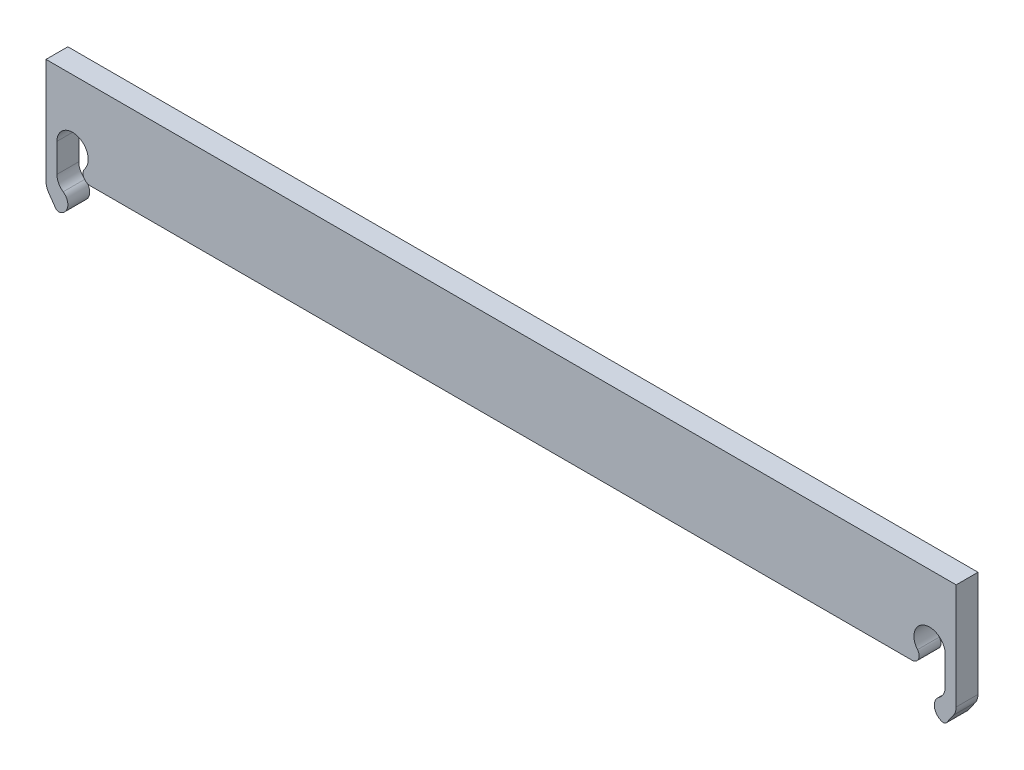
ISO-10303-21;
HEADER;
FILE_DESCRIPTION(('STEP AP214'),'2;1');
FILE_NAME('part.step','',(''),(''),'','','');
FILE_SCHEMA(('AUTOMOTIVE_DESIGN { 1 0 10303 214 1 1 1 1 }'));
ENDSEC;
DATA;
#1=APPLICATION_CONTEXT('core data for automotive mechanical design processes');
#2=APPLICATION_PROTOCOL_DEFINITION('international standard','automotive_design',2000,#1);
#3=PRODUCT_CONTEXT('',#1,'mechanical');
#4=PRODUCT('Part','Part','',(#3));
#5=PRODUCT_RELATED_PRODUCT_CATEGORY('part','',(#4));
#6=PRODUCT_DEFINITION_FORMATION('','',#4);
#7=PRODUCT_DEFINITION_CONTEXT('part definition',#1,'design');
#8=PRODUCT_DEFINITION('design','',#6,#7);
#9=PRODUCT_DEFINITION_SHAPE('','',#8);
#10=(LENGTH_UNIT() NAMED_UNIT(*) SI_UNIT(.MILLI.,.METRE.));
#11=(NAMED_UNIT(*) PLANE_ANGLE_UNIT() SI_UNIT($,.RADIAN.));
#12=(NAMED_UNIT(*) SI_UNIT($,.STERADIAN.) SOLID_ANGLE_UNIT());
#13=UNCERTAINTY_MEASURE_WITH_UNIT(LENGTH_MEASURE(1.E-05),#10,'distance_accuracy_value','');
#14=(GEOMETRIC_REPRESENTATION_CONTEXT(3) GLOBAL_UNCERTAINTY_ASSIGNED_CONTEXT((#13)) GLOBAL_UNIT_ASSIGNED_CONTEXT((#10,
#11,#12)) REPRESENTATION_CONTEXT('',''));
#15=CARTESIAN_POINT('',(0.,0.,0.));
#16=DIRECTION('',(0.,0.,1.));
#17=DIRECTION('',(1.,0.,0.));
#18=AXIS2_PLACEMENT_3D('',#15,#16,#17);
#19=CARTESIAN_POINT('',(-62.5,12.,3.));
#20=DIRECTION('',(1.,0.,0.));
#21=DIRECTION('',(0.,0.,-1.));
#22=AXIS2_PLACEMENT_3D('',#19,#20,#21);
#23=PLANE('',#22);
#24=DIRECTION('',(0.,-1.,0.));
#25=VECTOR('',#24,1.);
#26=CARTESIAN_POINT('',(-62.5,12.,0.));
#27=LINE('',#26,#25);
#28=CARTESIAN_POINT('',(-62.5,12.,0.));
#29=VERTEX_POINT('',#28);
#30=CARTESIAN_POINT('',(-62.5,-2.52740242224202,0.));
#31=VERTEX_POINT('',#30);
#32=EDGE_CURVE('E182',#29,#31,#27,.T.);
#33=ORIENTED_EDGE('',*,*,#32,.T.);
#34=DIRECTION('',(0.,0.,-1.));
#35=VECTOR('',#34,1.);
#36=CARTESIAN_POINT('',(-62.5,-2.52740242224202,3.));
#37=LINE('',#36,#35);
#38=CARTESIAN_POINT('',(-62.5,-2.52740242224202,3.));
#39=VERTEX_POINT('',#38);
#40=EDGE_CURVE('E9',#39,#31,#37,.T.);
#41=ORIENTED_EDGE('',*,*,#40,.F.);
#42=DIRECTION('',(0.,-1.,0.));
#43=VECTOR('',#42,1.);
#44=CARTESIAN_POINT('',(-62.5,12.,3.));
#45=LINE('',#44,#43);
#46=CARTESIAN_POINT('',(-62.5,12.,3.));
#47=VERTEX_POINT('',#46);
#48=EDGE_CURVE('E228',#47,#39,#45,.T.);
#49=ORIENTED_EDGE('',*,*,#48,.F.);
#50=DIRECTION('',(0.,0.,-1.));
#51=VECTOR('',#50,1.);
#52=CARTESIAN_POINT('',(-62.5,12.,3.));
#53=LINE('',#52,#51);
#54=EDGE_CURVE('E178',#47,#29,#53,.T.);
#55=ORIENTED_EDGE('',*,*,#54,.T.);
#56=EDGE_LOOP('',(#33,#41,#49,#55));
#57=FACE_BOUND('',#56,.T.);
#58=ADVANCED_FACE('F14',(#57),#23,.F.);
#59=CARTESIAN_POINT('',(-60.5,-2.52740242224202,3.));
#60=DIRECTION('',(0.,0.,-1.));
#61=DIRECTION('',(-1.,0.,0.));
#62=AXIS2_PLACEMENT_3D('',#59,#60,#61);
#63=CYLINDRICAL_SURFACE('',#62,2.);
#64=CARTESIAN_POINT('',(-60.5,-2.52740242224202,0.));
#65=DIRECTION('',(0.,0.,1.));
#66=DIRECTION('',(1.,0.,0.));
#67=AXIS2_PLACEMENT_3D('',#64,#65,#66);
#68=CIRCLE('',#67,2.);
#69=CARTESIAN_POINT('',(-62.138304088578,-3.67455529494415,0.));
#70=VERTEX_POINT('',#69);
#71=EDGE_CURVE('E185',#31,#70,#68,.T.);
#72=ORIENTED_EDGE('',*,*,#71,.T.);
#73=DIRECTION('',(0.,0.,-1.));
#74=VECTOR('',#73,1.);
#75=CARTESIAN_POINT('',(-62.138304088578,-3.67455529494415,3.));
#76=LINE('',#75,#74);
#77=CARTESIAN_POINT('',(-62.138304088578,-3.67455529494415,3.));
#78=VERTEX_POINT('',#77);
#79=EDGE_CURVE('E22',#78,#70,#76,.T.);
#80=ORIENTED_EDGE('',*,*,#79,.F.);
#81=CARTESIAN_POINT('',(-60.5,-2.52740242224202,3.));
#82=DIRECTION('',(0.,0.,1.));
#83=DIRECTION('',(1.,0.,0.));
#84=AXIS2_PLACEMENT_3D('',#81,#82,#83);
#85=CIRCLE('',#84,2.);
#86=EDGE_CURVE('E109',#39,#78,#85,.T.);
#87=ORIENTED_EDGE('',*,*,#86,.F.);
#88=ORIENTED_EDGE('',*,*,#40,.T.);
#89=EDGE_LOOP('',(#72,#80,#87,#88));
#90=FACE_BOUND('',#89,.T.);
#91=ADVANCED_FACE('F343',(#90),#63,.T.);
#92=CARTESIAN_POINT('',(-62.138304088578,-3.67455529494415,3.));
#93=DIRECTION('',(0.819152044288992,0.573576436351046,0.));
#94=DIRECTION('',(-0.573576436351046,0.819152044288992,0.));
#95=AXIS2_PLACEMENT_3D('',#92,#93,#94);
#96=PLANE('',#95);
#97=DIRECTION('',(0.573576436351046,-0.819152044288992,0.));
#98=VECTOR('',#97,1.);
#99=CARTESIAN_POINT('',(-62.138304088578,-3.67455529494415,0.));
#100=LINE('',#99,#98);
#101=CARTESIAN_POINT('',(-61.1698632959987,-5.05763208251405,0.));
#102=VERTEX_POINT('',#101);
#103=EDGE_CURVE('E187',#70,#102,#100,.T.);
#104=ORIENTED_EDGE('',*,*,#103,.T.);
#105=DIRECTION('',(0.,0.,-1.));
#106=VECTOR('',#105,1.);
#107=CARTESIAN_POINT('',(-61.1698632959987,-5.05763208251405,3.));
#108=LINE('',#107,#106);
#109=CARTESIAN_POINT('',(-61.1698632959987,-5.05763208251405,3.));
#110=VERTEX_POINT('',#109);
#111=EDGE_CURVE('E263',#110,#102,#108,.T.);
#112=ORIENTED_EDGE('',*,*,#111,.F.);
#113=DIRECTION('',(0.573576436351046,-0.819152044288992,0.));
#114=VECTOR('',#113,1.);
#115=CARTESIAN_POINT('',(-62.138304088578,-3.67455529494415,3.));
#116=LINE('',#115,#114);
#117=EDGE_CURVE('E271',#78,#110,#116,.T.);
#118=ORIENTED_EDGE('',*,*,#117,.F.);
#119=ORIENTED_EDGE('',*,*,#79,.T.);
#120=EDGE_LOOP('',(#104,#112,#118,#119));
#121=FACE_BOUND('',#120,.T.);
#122=ADVANCED_FACE('F269',(#121),#96,.F.);
#123=CARTESIAN_POINT('',(-60.7602872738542,-4.77084386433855,3.));
#124=DIRECTION('',(0.,0.,-1.));
#125=DIRECTION('',(-1.,0.,0.));
#126=AXIS2_PLACEMENT_3D('',#123,#124,#125);
#127=CYLINDRICAL_SURFACE('',#126,0.499999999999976);
#128=CARTESIAN_POINT('',(-60.7602872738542,-4.77084386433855,0.));
#129=DIRECTION('',(0.,0.,1.));
#130=DIRECTION('',(1.,0.,0.));
#131=AXIS2_PLACEMENT_3D('',#128,#129,#130);
#132=CIRCLE('',#131,0.499999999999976);
#133=CARTESIAN_POINT('',(-60.6404309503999,-5.2562658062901,0.));
#134=VERTEX_POINT('',#133);
#135=EDGE_CURVE('E189',#102,#134,#132,.T.);
#136=ORIENTED_EDGE('',*,*,#135,.T.);
#137=DIRECTION('',(0.,0.,-1.));
#138=VECTOR('',#137,1.);
#139=CARTESIAN_POINT('',(-60.6404309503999,-5.2562658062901,3.));
#140=LINE('',#139,#138);
#141=CARTESIAN_POINT('',(-60.6404309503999,-5.2562658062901,3.));
#142=VERTEX_POINT('',#141);
#143=EDGE_CURVE('E260',#142,#134,#140,.T.);
#144=ORIENTED_EDGE('',*,*,#143,.F.);
#145=CARTESIAN_POINT('',(-60.7602872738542,-4.77084386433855,3.));
#146=DIRECTION('',(0.,0.,1.));
#147=DIRECTION('',(1.,0.,0.));
#148=AXIS2_PLACEMENT_3D('',#145,#146,#147);
#149=CIRCLE('',#148,0.499999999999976);
#150=EDGE_CURVE('E289',#110,#142,#149,.T.);
#151=ORIENTED_EDGE('',*,*,#150,.F.);
#152=ORIENTED_EDGE('',*,*,#111,.T.);
#153=EDGE_LOOP('',(#136,#144,#151,#152));
#154=FACE_BOUND('',#153,.T.);
#155=ADVANCED_FACE('F279',(#154),#127,.T.);
#156=CARTESIAN_POINT('',(-61.,-3.8,3.));
#157=DIRECTION('',(0.,0.,-1.));
#158=DIRECTION('',(-1.,0.,0.));
#159=AXIS2_PLACEMENT_3D('',#156,#157,#158);
#160=CYLINDRICAL_SURFACE('',#159,1.5);
#161=CARTESIAN_POINT('',(-61.,-3.8,0.));
#162=DIRECTION('',(0.,0.,1.));
#163=DIRECTION('',(1.,0.,0.));
#164=AXIS2_PLACEMENT_3D('',#161,#162,#163);
#165=CIRCLE('',#164,1.5);
#166=CARTESIAN_POINT('',(-60.1428571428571,-2.56902229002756,0.));
#167=VERTEX_POINT('',#166);
#168=EDGE_CURVE('E191',#134,#167,#165,.T.);
#169=ORIENTED_EDGE('',*,*,#168,.T.);
#170=DIRECTION('',(0.,0.,-1.));
#171=VECTOR('',#170,1.);
#172=CARTESIAN_POINT('',(-60.1428571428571,-2.56902229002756,3.));
#173=LINE('',#172,#171);
#174=CARTESIAN_POINT('',(-60.1428571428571,-2.56902229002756,3.));
#175=VERTEX_POINT('',#174);
#176=EDGE_CURVE('E258',#175,#167,#173,.T.);
#177=ORIENTED_EDGE('',*,*,#176,.F.);
#178=CARTESIAN_POINT('',(-61.,-3.8,3.));
#179=DIRECTION('',(0.,0.,1.));
#180=DIRECTION('',(1.,0.,0.));
#181=AXIS2_PLACEMENT_3D('',#178,#179,#180);
#182=CIRCLE('',#181,1.5);
#183=EDGE_CURVE('E285',#142,#175,#182,.T.);
#184=ORIENTED_EDGE('',*,*,#183,.F.);
#185=ORIENTED_EDGE('',*,*,#143,.T.);
#186=EDGE_LOOP('',(#169,#177,#184,#185));
#187=FACE_BOUND('',#186,.T.);
#188=ADVANCED_FACE('F283',(#187),#160,.T.);
#189=CARTESIAN_POINT('',(-59.,-0.92771867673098,3.));
#190=DIRECTION('',(0.,0.,-1.));
#191=DIRECTION('',(-1.,0.,0.));
#192=AXIS2_PLACEMENT_3D('',#189,#190,#191);
#193=CYLINDRICAL_SURFACE('',#192,2.);
#194=CARTESIAN_POINT('',(-59.,-0.92771867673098,0.));
#195=DIRECTION('',(0.,0.,1.));
#196=DIRECTION('',(1.,0.,0.));
#197=AXIS2_PLACEMENT_3D('',#194,#195,#196);
#198=CIRCLE('',#197,2.);
#199=CARTESIAN_POINT('',(-61.,-0.92771867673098,0.));
#200=VERTEX_POINT('',#199);
#201=EDGE_CURVE('E194',#200,#167,#198,.T.);
#202=ORIENTED_EDGE('',*,*,#201,.F.);
#203=DIRECTION('',(0.,0.,-1.));
#204=VECTOR('',#203,1.);
#205=CARTESIAN_POINT('',(-61.,-0.92771867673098,3.));
#206=LINE('',#205,#204);
#207=CARTESIAN_POINT('',(-61.,-0.92771867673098,3.));
#208=VERTEX_POINT('',#207);
#209=EDGE_CURVE('E256',#208,#200,#206,.T.);
#210=ORIENTED_EDGE('',*,*,#209,.F.);
#211=CARTESIAN_POINT('',(-59.,-0.92771867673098,3.));
#212=DIRECTION('',(0.,0.,1.));
#213=DIRECTION('',(1.,0.,0.));
#214=AXIS2_PLACEMENT_3D('',#211,#212,#213);
#215=CIRCLE('',#214,2.);
#216=EDGE_CURVE('E288',#208,#175,#215,.T.);
#217=ORIENTED_EDGE('',*,*,#216,.T.);
#218=ORIENTED_EDGE('',*,*,#176,.T.);
#219=EDGE_LOOP('',(#202,#210,#217,#218));
#220=FACE_BOUND('',#219,.T.);
#221=ADVANCED_FACE('F356',(#220),#193,.F.);
#222=CARTESIAN_POINT('',(-61.,-0.92771867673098,3.));
#223=DIRECTION('',(-1.,0.,0.));
#224=DIRECTION('',(0.,0.,1.));
#225=AXIS2_PLACEMENT_3D('',#222,#223,#224);
#226=PLANE('',#225);
#227=DIRECTION('',(0.,1.,0.));
#228=VECTOR('',#227,1.);
#229=CARTESIAN_POINT('',(-61.,-0.92771867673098,0.));
#230=LINE('',#229,#228);
#231=CARTESIAN_POINT('',(-61.,3.,0.));
#232=VERTEX_POINT('',#231);
#233=EDGE_CURVE('E197',#200,#232,#230,.T.);
#234=ORIENTED_EDGE('',*,*,#233,.T.);
#235=DIRECTION('',(0.,0.,-1.));
#236=VECTOR('',#235,1.);
#237=CARTESIAN_POINT('',(-61.,3.,3.));
#238=LINE('',#237,#236);
#239=CARTESIAN_POINT('',(-61.,3.,3.));
#240=VERTEX_POINT('',#239);
#241=EDGE_CURVE('E254',#240,#232,#238,.T.);
#242=ORIENTED_EDGE('',*,*,#241,.F.);
#243=DIRECTION('',(0.,1.,0.));
#244=VECTOR('',#243,1.);
#245=CARTESIAN_POINT('',(-61.,-0.92771867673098,3.));
#246=LINE('',#245,#244);
#247=EDGE_CURVE('E291',#208,#240,#246,.T.);
#248=ORIENTED_EDGE('',*,*,#247,.F.);
#249=ORIENTED_EDGE('',*,*,#209,.T.);
#250=EDGE_LOOP('',(#234,#242,#248,#249));
#251=FACE_BOUND('',#250,.T.);
#252=ADVANCED_FACE('F359',(#251),#226,.F.);
#253=CARTESIAN_POINT('',(-58.85,3.,3.));
#254=DIRECTION('',(0.,0.,-1.));
#255=DIRECTION('',(-1.,0.,0.));
#256=AXIS2_PLACEMENT_3D('',#253,#254,#255);
#257=CYLINDRICAL_SURFACE('',#256,2.15);
#258=CARTESIAN_POINT('',(-58.85,3.,0.));
#259=DIRECTION('',(0.,0.,1.));
#260=DIRECTION('',(1.,0.,0.));
#261=AXIS2_PLACEMENT_3D('',#258,#259,#260);
#262=CIRCLE('',#261,2.15);
#263=CARTESIAN_POINT('',(-57.1889586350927,1.63492066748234,0.));
#264=VERTEX_POINT('',#263);
#265=EDGE_CURVE('E200',#264,#232,#262,.T.);
#266=ORIENTED_EDGE('',*,*,#265,.F.);
#267=DIRECTION('',(0.,0.,-1.));
#268=VECTOR('',#267,1.);
#269=CARTESIAN_POINT('',(-57.1889586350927,1.63492066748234,3.));
#270=LINE('',#269,#268);
#271=CARTESIAN_POINT('',(-57.1889586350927,1.63492066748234,3.));
#272=VERTEX_POINT('',#271);
#273=EDGE_CURVE('E252',#272,#264,#270,.T.);
#274=ORIENTED_EDGE('',*,*,#273,.F.);
#275=CARTESIAN_POINT('',(-58.85,3.,3.));
#276=DIRECTION('',(0.,0.,1.));
#277=DIRECTION('',(1.,0.,0.));
#278=AXIS2_PLACEMENT_3D('',#275,#276,#277);
#279=CIRCLE('',#278,2.15);
#280=EDGE_CURVE('E297',#272,#240,#279,.T.);
#281=ORIENTED_EDGE('',*,*,#280,.T.);
#282=ORIENTED_EDGE('',*,*,#241,.T.);
#283=EDGE_LOOP('',(#266,#274,#281,#282));
#284=FACE_BOUND('',#283,.T.);
#285=ADVANCED_FACE('F363',(#284),#257,.F.);
#286=CARTESIAN_POINT('',(-56.4163812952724,1.,3.));
#287=DIRECTION('',(0.,0.,-1.));
#288=DIRECTION('',(-1.,0.,0.));
#289=AXIS2_PLACEMENT_3D('',#286,#287,#288);
#290=CYLINDRICAL_SURFACE('',#289,1.);
#291=CARTESIAN_POINT('',(-56.4163812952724,1.,0.));
#292=DIRECTION('',(0.,0.,1.));
#293=DIRECTION('',(1.,0.,0.));
#294=AXIS2_PLACEMENT_3D('',#291,#292,#293);
#295=CIRCLE('',#294,1.);
#296=CARTESIAN_POINT('',(-56.4163812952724,0.,0.));
#297=VERTEX_POINT('',#296);
#298=EDGE_CURVE('E203',#264,#297,#295,.T.);
#299=ORIENTED_EDGE('',*,*,#298,.T.);
#300=DIRECTION('',(0.,0.,-1.));
#301=VECTOR('',#300,1.);
#302=CARTESIAN_POINT('',(-56.4163812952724,0.,3.));
#303=LINE('',#302,#301);
#304=CARTESIAN_POINT('',(-56.4163812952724,0.,3.));
#305=VERTEX_POINT('',#304);
#306=EDGE_CURVE('E249',#305,#297,#303,.T.);
#307=ORIENTED_EDGE('',*,*,#306,.F.);
#308=CARTESIAN_POINT('',(-56.4163812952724,1.,3.));
#309=DIRECTION('',(0.,0.,1.));
#310=DIRECTION('',(1.,0.,0.));
#311=AXIS2_PLACEMENT_3D('',#308,#309,#310);
#312=CIRCLE('',#311,1.);
#313=EDGE_CURVE('E300',#272,#305,#312,.T.);
#314=ORIENTED_EDGE('',*,*,#313,.F.);
#315=ORIENTED_EDGE('',*,*,#273,.T.);
#316=EDGE_LOOP('',(#299,#307,#314,#315));
#317=FACE_BOUND('',#316,.T.);
#318=ADVANCED_FACE('F367',(#317),#290,.T.);
#319=CARTESIAN_POINT('',(-56.4163812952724,0.,3.));
#320=DIRECTION('',(0.,1.,0.));
#321=DIRECTION('',(0.,0.,1.));
#322=AXIS2_PLACEMENT_3D('',#319,#320,#321);
#323=PLANE('',#322);
#324=DIRECTION('',(1.,0.,0.));
#325=VECTOR('',#324,1.);
#326=CARTESIAN_POINT('',(-56.4163812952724,0.,0.));
#327=LINE('',#326,#325);
#328=CARTESIAN_POINT('',(56.4163812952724,0.,0.));
#329=VERTEX_POINT('',#328);
#330=EDGE_CURVE('E205',#297,#329,#327,.T.);
#331=ORIENTED_EDGE('',*,*,#330,.T.);
#332=DIRECTION('',(0.,0.,-1.));
#333=VECTOR('',#332,1.);
#334=CARTESIAN_POINT('',(56.4163812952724,0.,3.));
#335=LINE('',#334,#333);
#336=CARTESIAN_POINT('',(56.4163812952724,0.,3.));
#337=VERTEX_POINT('',#336);
#338=EDGE_CURVE('E246',#337,#329,#335,.T.);
#339=ORIENTED_EDGE('',*,*,#338,.F.);
#340=DIRECTION('',(1.,0.,0.));
#341=VECTOR('',#340,1.);
#342=CARTESIAN_POINT('',(-56.4163812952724,0.,3.));
#343=LINE('',#342,#341);
#344=EDGE_CURVE('E302',#305,#337,#343,.T.);
#345=ORIENTED_EDGE('',*,*,#344,.F.);
#346=ORIENTED_EDGE('',*,*,#306,.T.);
#347=EDGE_LOOP('',(#331,#339,#345,#346));
#348=FACE_BOUND('',#347,.T.);
#349=ADVANCED_FACE('F371',(#348),#323,.F.);
#350=CARTESIAN_POINT('',(56.4163812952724,1.,3.));
#351=DIRECTION('',(0.,0.,-1.));
#352=DIRECTION('',(-1.,0.,0.));
#353=AXIS2_PLACEMENT_3D('',#350,#351,#352);
#354=CYLINDRICAL_SURFACE('',#353,1.);
#355=CARTESIAN_POINT('',(56.4163812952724,1.,0.));
#356=DIRECTION('',(0.,0.,1.));
#357=DIRECTION('',(1.,0.,0.));
#358=AXIS2_PLACEMENT_3D('',#355,#356,#357);
#359=CIRCLE('',#358,1.);
#360=CARTESIAN_POINT('',(57.1889585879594,1.63492072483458,0.));
#361=VERTEX_POINT('',#360);
#362=EDGE_CURVE('E207',#329,#361,#359,.T.);
#363=ORIENTED_EDGE('',*,*,#362,.T.);
#364=DIRECTION('',(0.,0.,-1.));
#365=VECTOR('',#364,1.);
#366=CARTESIAN_POINT('',(57.1889585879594,1.63492072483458,3.));
#367=LINE('',#366,#365);
#368=CARTESIAN_POINT('',(57.1889585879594,1.63492072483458,3.));
#369=VERTEX_POINT('',#368);
#370=EDGE_CURVE('E244',#369,#361,#367,.T.);
#371=ORIENTED_EDGE('',*,*,#370,.F.);
#372=CARTESIAN_POINT('',(56.4163812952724,1.,3.));
#373=DIRECTION('',(0.,0.,1.));
#374=DIRECTION('',(1.,0.,0.));
#375=AXIS2_PLACEMENT_3D('',#372,#373,#374);
#376=CIRCLE('',#375,1.);
#377=EDGE_CURVE('E304',#337,#369,#376,.T.);
#378=ORIENTED_EDGE('',*,*,#377,.F.);
#379=ORIENTED_EDGE('',*,*,#338,.T.);
#380=EDGE_LOOP('',(#363,#371,#378,#379));
#381=FACE_BOUND('',#380,.T.);
#382=ADVANCED_FACE('F375',(#381),#354,.T.);
#383=CARTESIAN_POINT('',(58.85,3.,3.));
#384=DIRECTION('',(0.,0.,-1.));
#385=DIRECTION('',(-1.,0.,0.));
#386=AXIS2_PLACEMENT_3D('',#383,#384,#385);
#387=CYLINDRICAL_SURFACE('',#386,2.15);
#388=CARTESIAN_POINT('',(58.85,3.,0.));
#389=DIRECTION('',(0.,0.,1.));
#390=DIRECTION('',(1.,0.,0.));
#391=AXIS2_PLACEMENT_3D('',#388,#389,#390);
#392=CIRCLE('',#391,2.15);
#393=CARTESIAN_POINT('',(61.,3.,0.));
#394=VERTEX_POINT('',#393);
#395=EDGE_CURVE('E210',#394,#361,#392,.T.);
#396=ORIENTED_EDGE('',*,*,#395,.F.);
#397=DIRECTION('',(0.,0.,-1.));
#398=VECTOR('',#397,1.);
#399=CARTESIAN_POINT('',(61.,3.,3.));
#400=LINE('',#399,#398);
#401=CARTESIAN_POINT('',(61.,3.,3.));
#402=VERTEX_POINT('',#401);
#403=EDGE_CURVE('E242',#402,#394,#400,.T.);
#404=ORIENTED_EDGE('',*,*,#403,.F.);
#405=CARTESIAN_POINT('',(58.85,3.,3.));
#406=DIRECTION('',(0.,0.,1.));
#407=DIRECTION('',(1.,0.,0.));
#408=AXIS2_PLACEMENT_3D('',#405,#406,#407);
#409=CIRCLE('',#408,2.15);
#410=EDGE_CURVE('E306',#402,#369,#409,.T.);
#411=ORIENTED_EDGE('',*,*,#410,.T.);
#412=ORIENTED_EDGE('',*,*,#370,.T.);
#413=EDGE_LOOP('',(#396,#404,#411,#412));
#414=FACE_BOUND('',#413,.T.);
#415=ADVANCED_FACE('F379',(#414),#387,.F.);
#416=CARTESIAN_POINT('',(61.,3.,3.));
#417=DIRECTION('',(1.,0.,0.));
#418=DIRECTION('',(0.,0.,-1.));
#419=AXIS2_PLACEMENT_3D('',#416,#417,#418);
#420=PLANE('',#419);
#421=DIRECTION('',(0.,-1.,0.));
#422=VECTOR('',#421,1.);
#423=CARTESIAN_POINT('',(61.,3.,0.));
#424=LINE('',#423,#422);
#425=CARTESIAN_POINT('',(61.,-0.92771867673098,0.));
#426=VERTEX_POINT('',#425);
#427=EDGE_CURVE('E213',#394,#426,#424,.T.);
#428=ORIENTED_EDGE('',*,*,#427,.T.);
#429=DIRECTION('',(0.,0.,-1.));
#430=VECTOR('',#429,1.);
#431=CARTESIAN_POINT('',(61.,-0.92771867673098,3.));
#432=LINE('',#431,#430);
#433=CARTESIAN_POINT('',(61.,-0.92771867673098,3.));
#434=VERTEX_POINT('',#433);
#435=EDGE_CURVE('E240',#434,#426,#432,.T.);
#436=ORIENTED_EDGE('',*,*,#435,.F.);
#437=DIRECTION('',(0.,-1.,0.));
#438=VECTOR('',#437,1.);
#439=CARTESIAN_POINT('',(61.,3.,3.));
#440=LINE('',#439,#438);
#441=EDGE_CURVE('E309',#402,#434,#440,.T.);
#442=ORIENTED_EDGE('',*,*,#441,.F.);
#443=ORIENTED_EDGE('',*,*,#403,.T.);
#444=EDGE_LOOP('',(#428,#436,#442,#443));
#445=FACE_BOUND('',#444,.T.);
#446=ADVANCED_FACE('F383',(#445),#420,.F.);
#447=CARTESIAN_POINT('',(59.,-0.927718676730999,3.));
#448=DIRECTION('',(0.,0.,-1.));
#449=DIRECTION('',(-1.,0.,0.));
#450=AXIS2_PLACEMENT_3D('',#447,#448,#449);
#451=CYLINDRICAL_SURFACE('',#450,1.99999999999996);
#452=CARTESIAN_POINT('',(59.,-0.927718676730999,0.));
#453=DIRECTION('',(0.,0.,1.));
#454=DIRECTION('',(1.,0.,0.));
#455=AXIS2_PLACEMENT_3D('',#452,#453,#454);
#456=CIRCLE('',#455,1.99999999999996);
#457=CARTESIAN_POINT('',(60.142857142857,-2.56902229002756,0.));
#458=VERTEX_POINT('',#457);
#459=EDGE_CURVE('E216',#458,#426,#456,.T.);
#460=ORIENTED_EDGE('',*,*,#459,.F.);
#461=DIRECTION('',(0.,0.,-1.));
#462=VECTOR('',#461,1.);
#463=CARTESIAN_POINT('',(60.142857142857,-2.56902229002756,3.));
#464=LINE('',#463,#462);
#465=CARTESIAN_POINT('',(60.142857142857,-2.56902229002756,3.));
#466=VERTEX_POINT('',#465);
#467=EDGE_CURVE('E238',#466,#458,#464,.T.);
#468=ORIENTED_EDGE('',*,*,#467,.F.);
#469=CARTESIAN_POINT('',(59.,-0.927718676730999,3.));
#470=DIRECTION('',(0.,0.,1.));
#471=DIRECTION('',(1.,0.,0.));
#472=AXIS2_PLACEMENT_3D('',#469,#470,#471);
#473=CIRCLE('',#472,1.99999999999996);
#474=EDGE_CURVE('E311',#466,#434,#473,.T.);
#475=ORIENTED_EDGE('',*,*,#474,.T.);
#476=ORIENTED_EDGE('',*,*,#435,.T.);
#477=EDGE_LOOP('',(#460,#468,#475,#476));
#478=FACE_BOUND('',#477,.T.);
#479=ADVANCED_FACE('F387',(#478),#451,.F.);
#480=CARTESIAN_POINT('',(61.,-3.8,3.));
#481=DIRECTION('',(0.,0.,-1.));
#482=DIRECTION('',(-1.,0.,0.));
#483=AXIS2_PLACEMENT_3D('',#480,#481,#482);
#484=CYLINDRICAL_SURFACE('',#483,1.5);
#485=CARTESIAN_POINT('',(61.,-3.8,0.));
#486=DIRECTION('',(0.,0.,1.));
#487=DIRECTION('',(1.,0.,0.));
#488=AXIS2_PLACEMENT_3D('',#485,#486,#487);
#489=CIRCLE('',#488,1.5);
#490=CARTESIAN_POINT('',(60.6404309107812,-5.25626579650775,0.));
#491=VERTEX_POINT('',#490);
#492=EDGE_CURVE('E219',#458,#491,#489,.T.);
#493=ORIENTED_EDGE('',*,*,#492,.T.);
#494=DIRECTION('',(0.,0.,-1.));
#495=VECTOR('',#494,1.);
#496=CARTESIAN_POINT('',(60.6404309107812,-5.25626579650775,3.));
#497=LINE('',#496,#495);
#498=CARTESIAN_POINT('',(60.6404309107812,-5.25626579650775,3.));
#499=VERTEX_POINT('',#498);
#500=EDGE_CURVE('E235',#499,#491,#497,.T.);
#501=ORIENTED_EDGE('',*,*,#500,.F.);
#502=CARTESIAN_POINT('',(61.,-3.8,3.));
#503=DIRECTION('',(0.,0.,1.));
#504=DIRECTION('',(1.,0.,0.));
#505=AXIS2_PLACEMENT_3D('',#502,#503,#504);
#506=CIRCLE('',#505,1.5);
#507=EDGE_CURVE('E314',#466,#499,#506,.T.);
#508=ORIENTED_EDGE('',*,*,#507,.F.);
#509=ORIENTED_EDGE('',*,*,#467,.T.);
#510=EDGE_LOOP('',(#493,#501,#508,#509));
#511=FACE_BOUND('',#510,.T.);
#512=ADVANCED_FACE('F391',(#511),#484,.T.);
#513=CARTESIAN_POINT('',(60.7602872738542,-4.7708438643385,3.));
#514=DIRECTION('',(0.,0.,-1.));
#515=DIRECTION('',(-1.,0.,0.));
#516=AXIS2_PLACEMENT_3D('',#513,#514,#515);
#517=CYLINDRICAL_SURFACE('',#516,0.500000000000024);
#518=CARTESIAN_POINT('',(60.7602872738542,-4.7708438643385,0.));
#519=DIRECTION('',(0.,0.,1.));
#520=DIRECTION('',(1.,0.,0.));
#521=AXIS2_PLACEMENT_3D('',#518,#519,#520);
#522=CIRCLE('',#521,0.500000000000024);
#523=CARTESIAN_POINT('',(61.1698632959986,-5.05763208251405,0.));
#524=VERTEX_POINT('',#523);
#525=EDGE_CURVE('E221',#491,#524,#522,.T.);
#526=ORIENTED_EDGE('',*,*,#525,.T.);
#527=DIRECTION('',(0.,0.,-1.));
#528=VECTOR('',#527,1.);
#529=CARTESIAN_POINT('',(61.1698632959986,-5.05763208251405,3.));
#530=LINE('',#529,#528);
#531=CARTESIAN_POINT('',(61.1698632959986,-5.05763208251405,3.));
#532=VERTEX_POINT('',#531);
#533=EDGE_CURVE('E232',#532,#524,#530,.T.);
#534=ORIENTED_EDGE('',*,*,#533,.F.);
#535=CARTESIAN_POINT('',(60.7602872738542,-4.7708438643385,3.));
#536=DIRECTION('',(0.,0.,1.));
#537=DIRECTION('',(1.,0.,0.));
#538=AXIS2_PLACEMENT_3D('',#535,#536,#537);
#539=CIRCLE('',#538,0.500000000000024);
#540=EDGE_CURVE('E316',#499,#532,#539,.T.);
#541=ORIENTED_EDGE('',*,*,#540,.F.);
#542=ORIENTED_EDGE('',*,*,#500,.T.);
#543=EDGE_LOOP('',(#526,#534,#541,#542));
#544=FACE_BOUND('',#543,.T.);
#545=ADVANCED_FACE('F323',(#544),#517,.T.);
#546=CARTESIAN_POINT('',(61.1698632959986,-5.05763208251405,3.));
#547=DIRECTION('',(-0.819152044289,0.573576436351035,0.));
#548=DIRECTION('',(-0.573576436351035,-0.819152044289,0.));
#549=AXIS2_PLACEMENT_3D('',#546,#547,#548);
#550=PLANE('',#549);
#551=DIRECTION('',(0.573576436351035,0.819152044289,0.));
#552=VECTOR('',#551,1.);
#553=CARTESIAN_POINT('',(61.1698632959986,-5.05763208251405,0.));
#554=LINE('',#553,#552);
#555=CARTESIAN_POINT('',(62.138304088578,-3.6745552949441,0.));
#556=VERTEX_POINT('',#555);
#557=EDGE_CURVE('E223',#524,#556,#554,.T.);
#558=ORIENTED_EDGE('',*,*,#557,.T.);
#559=DIRECTION('',(0.,0.,-1.));
#560=VECTOR('',#559,1.);
#561=CARTESIAN_POINT('',(62.138304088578,-3.6745552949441,3.));
#562=LINE('',#561,#560);
#563=CARTESIAN_POINT('',(62.138304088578,-3.6745552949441,3.));
#564=VERTEX_POINT('',#563);
#565=EDGE_CURVE('E173',#564,#556,#562,.T.);
#566=ORIENTED_EDGE('',*,*,#565,.F.);
#567=DIRECTION('',(0.573576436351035,0.819152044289,0.));
#568=VECTOR('',#567,1.);
#569=CARTESIAN_POINT('',(61.1698632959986,-5.05763208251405,3.));
#570=LINE('',#569,#568);
#571=EDGE_CURVE('E164',#532,#564,#570,.T.);
#572=ORIENTED_EDGE('',*,*,#571,.F.);
#573=ORIENTED_EDGE('',*,*,#533,.T.);
#574=EDGE_LOOP('',(#558,#566,#572,#573));
#575=FACE_BOUND('',#574,.T.);
#576=ADVANCED_FACE('F327',(#575),#550,.F.);
#577=CARTESIAN_POINT('',(60.5,-2.52740242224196,3.));
#578=DIRECTION('',(0.,0.,-1.));
#579=DIRECTION('',(-1.,0.,0.));
#580=AXIS2_PLACEMENT_3D('',#577,#578,#579);
#581=CYLINDRICAL_SURFACE('',#580,2.00000000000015);
#582=CARTESIAN_POINT('',(60.5,-2.52740242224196,0.));
#583=DIRECTION('',(0.,0.,1.));
#584=DIRECTION('',(1.,0.,0.));
#585=AXIS2_PLACEMENT_3D('',#582,#583,#584);
#586=CIRCLE('',#585,2.00000000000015);
#587=CARTESIAN_POINT('',(62.5,-2.52740242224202,0.));
#588=VERTEX_POINT('',#587);
#589=EDGE_CURVE('E172',#556,#588,#586,.T.);
#590=ORIENTED_EDGE('',*,*,#589,.T.);
#591=DIRECTION('',(0.,0.,-1.));
#592=VECTOR('',#591,1.);
#593=CARTESIAN_POINT('',(62.5,-2.52740242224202,3.));
#594=LINE('',#593,#592);
#595=CARTESIAN_POINT('',(62.5,-2.52740242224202,3.));
#596=VERTEX_POINT('',#595);
#597=EDGE_CURVE('E169',#596,#588,#594,.T.);
#598=ORIENTED_EDGE('',*,*,#597,.F.);
#599=CARTESIAN_POINT('',(60.5,-2.52740242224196,3.));
#600=DIRECTION('',(0.,0.,1.));
#601=DIRECTION('',(1.,0.,0.));
#602=AXIS2_PLACEMENT_3D('',#599,#600,#601);
#603=CIRCLE('',#602,2.00000000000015);
#604=EDGE_CURVE('E158',#564,#596,#603,.T.);
#605=ORIENTED_EDGE('',*,*,#604,.F.);
#606=ORIENTED_EDGE('',*,*,#565,.T.);
#607=EDGE_LOOP('',(#590,#598,#605,#606));
#608=FACE_BOUND('',#607,.T.);
#609=ADVANCED_FACE('F170',(#608),#581,.T.);
#610=CARTESIAN_POINT('',(62.5,-2.52740242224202,3.));
#611=DIRECTION('',(-1.,0.,0.));
#612=DIRECTION('',(0.,0.,1.));
#613=AXIS2_PLACEMENT_3D('',#610,#611,#612);
#614=PLANE('',#613);
#615=DIRECTION('',(0.,1.,0.));
#616=VECTOR('',#615,1.);
#617=CARTESIAN_POINT('',(62.5,-2.52740242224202,0.));
#618=LINE('',#617,#616);
#619=CARTESIAN_POINT('',(62.5,12.,0.));
#620=VERTEX_POINT('',#619);
#621=EDGE_CURVE('E95',#588,#620,#618,.T.);
#622=ORIENTED_EDGE('',*,*,#621,.T.);
#623=DIRECTION('',(0.,0.,-1.));
#624=VECTOR('',#623,1.);
#625=CARTESIAN_POINT('',(62.5,12.,3.));
#626=LINE('',#625,#624);
#627=CARTESIAN_POINT('',(62.5,12.,3.));
#628=VERTEX_POINT('',#627);
#629=EDGE_CURVE('E174',#628,#620,#626,.T.);
#630=ORIENTED_EDGE('',*,*,#629,.F.);
#631=DIRECTION('',(0.,1.,0.));
#632=VECTOR('',#631,1.);
#633=CARTESIAN_POINT('',(62.5,-2.52740242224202,3.));
#634=LINE('',#633,#632);
#635=EDGE_CURVE('E162',#596,#628,#634,.T.);
#636=ORIENTED_EDGE('',*,*,#635,.F.);
#637=ORIENTED_EDGE('',*,*,#597,.T.);
#638=EDGE_LOOP('',(#622,#630,#636,#637));
#639=FACE_BOUND('',#638,.T.);
#640=ADVANCED_FACE('F176',(#639),#614,.F.);
#641=CARTESIAN_POINT('',(62.5,12.,3.));
#642=DIRECTION('',(0.,-1.,0.));
#643=DIRECTION('',(0.,0.,-1.));
#644=AXIS2_PLACEMENT_3D('',#641,#642,#643);
#645=PLANE('',#644);
#646=DIRECTION('',(-1.,0.,0.));
#647=VECTOR('',#646,1.);
#648=CARTESIAN_POINT('',(62.5,12.,0.));
#649=LINE('',#648,#647);
#650=EDGE_CURVE('E101',#620,#29,#649,.T.);
#651=ORIENTED_EDGE('',*,*,#650,.T.);
#652=ORIENTED_EDGE('',*,*,#54,.F.);
#653=DIRECTION('',(-1.,0.,0.));
#654=VECTOR('',#653,1.);
#655=CARTESIAN_POINT('',(62.5,12.,3.));
#656=LINE('',#655,#654);
#657=EDGE_CURVE('E30',#628,#47,#656,.T.);
#658=ORIENTED_EDGE('',*,*,#657,.F.);
#659=ORIENTED_EDGE('',*,*,#629,.T.);
#660=EDGE_LOOP('',(#651,#652,#658,#659));
#661=FACE_BOUND('',#660,.T.);
#662=ADVANCED_FACE('F331',(#661),#645,.F.);
#663=CARTESIAN_POINT('',(-60.5,-2.52740242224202,3.));
#664=DIRECTION('',(0.,0.,1.));
#665=DIRECTION('',(1.,0.,0.));
#666=AXIS2_PLACEMENT_3D('',#663,#664,#665);
#667=PLANE('',#666);
#668=ORIENTED_EDGE('',*,*,#48,.T.);
#669=ORIENTED_EDGE('',*,*,#86,.T.);
#670=ORIENTED_EDGE('',*,*,#117,.T.);
#671=ORIENTED_EDGE('',*,*,#150,.T.);
#672=ORIENTED_EDGE('',*,*,#183,.T.);
#673=ORIENTED_EDGE('',*,*,#216,.F.);
#674=ORIENTED_EDGE('',*,*,#247,.T.);
#675=ORIENTED_EDGE('',*,*,#280,.F.);
#676=ORIENTED_EDGE('',*,*,#313,.T.);
#677=ORIENTED_EDGE('',*,*,#344,.T.);
#678=ORIENTED_EDGE('',*,*,#377,.T.);
#679=ORIENTED_EDGE('',*,*,#410,.F.);
#680=ORIENTED_EDGE('',*,*,#441,.T.);
#681=ORIENTED_EDGE('',*,*,#474,.F.);
#682=ORIENTED_EDGE('',*,*,#507,.T.);
#683=ORIENTED_EDGE('',*,*,#540,.T.);
#684=ORIENTED_EDGE('',*,*,#571,.T.);
#685=ORIENTED_EDGE('',*,*,#604,.T.);
#686=ORIENTED_EDGE('',*,*,#635,.T.);
#687=ORIENTED_EDGE('',*,*,#657,.T.);
#688=EDGE_LOOP('',(#668,#669,#670,#671,#672,#673,#674,#675,#676,#677,#678,#679,#680,#681,#682,
#683,#684,#685,#686,#687));
#689=FACE_BOUND('',#688,.T.);
#690=ADVANCED_FACE('F160',(#689),#667,.T.);
#691=CARTESIAN_POINT('',(-60.5,-2.52740242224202,0.));
#692=DIRECTION('',(0.,0.,1.));
#693=DIRECTION('',(1.,0.,0.));
#694=AXIS2_PLACEMENT_3D('',#691,#692,#693);
#695=PLANE('',#694);
#696=ORIENTED_EDGE('',*,*,#32,.F.);
#697=ORIENTED_EDGE('',*,*,#650,.F.);
#698=ORIENTED_EDGE('',*,*,#621,.F.);
#699=ORIENTED_EDGE('',*,*,#589,.F.);
#700=ORIENTED_EDGE('',*,*,#557,.F.);
#701=ORIENTED_EDGE('',*,*,#525,.F.);
#702=ORIENTED_EDGE('',*,*,#492,.F.);
#703=ORIENTED_EDGE('',*,*,#459,.T.);
#704=ORIENTED_EDGE('',*,*,#427,.F.);
#705=ORIENTED_EDGE('',*,*,#395,.T.);
#706=ORIENTED_EDGE('',*,*,#362,.F.);
#707=ORIENTED_EDGE('',*,*,#330,.F.);
#708=ORIENTED_EDGE('',*,*,#298,.F.);
#709=ORIENTED_EDGE('',*,*,#265,.T.);
#710=ORIENTED_EDGE('',*,*,#233,.F.);
#711=ORIENTED_EDGE('',*,*,#201,.T.);
#712=ORIENTED_EDGE('',*,*,#168,.F.);
#713=ORIENTED_EDGE('',*,*,#135,.F.);
#714=ORIENTED_EDGE('',*,*,#103,.F.);
#715=ORIENTED_EDGE('',*,*,#71,.F.);
#716=EDGE_LOOP('',(#696,#697,#698,#699,#700,#701,#702,#703,#704,#705,#706,#707,#708,#709,#710,
#711,#712,#713,#714,#715));
#717=FACE_BOUND('',#716,.T.);
#718=ADVANCED_FACE('F275',(#717),#695,.F.);
#719=CLOSED_SHELL('',(#58,#91,#122,#155,#188,#221,#252,#285,#318,#349,#382,#415,#446,#479,#512,
#545,#576,#609,#640,#662,#690,#718));
#720=MANIFOLD_SOLID_BREP('B1',#719);
#721=ADVANCED_BREP_SHAPE_REPRESENTATION('',(#18,#720),#14);
#722=SHAPE_DEFINITION_REPRESENTATION(#9,#721);
ENDSEC;
END-ISO-10303-21;
